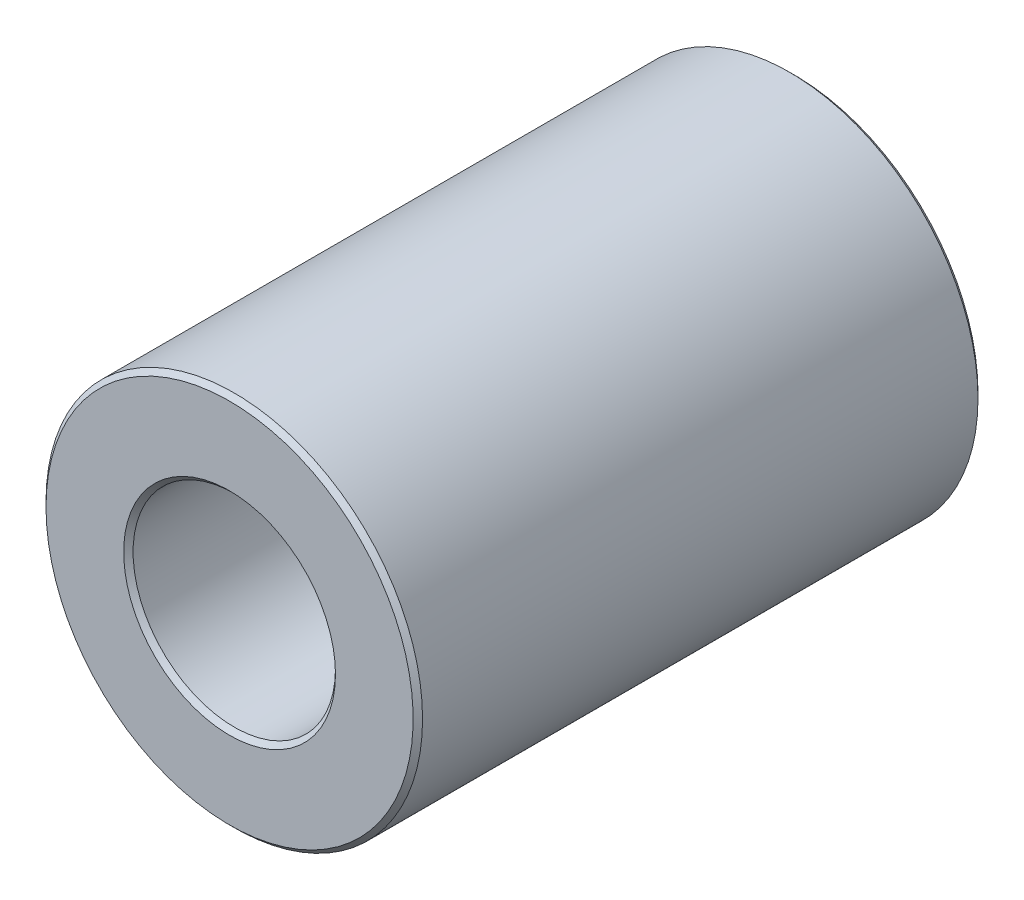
from build123d import *

# Parameters (mm, degrees)
SKETCH1_R           = 4
SKETCH1_R_2         = 2.15
BOSS_EXTRUDE2_DEPTH = 6
CHAMFER3_SIZE       = 0.1


with BuildPart() as part:
    # Sketch1 → Boss-Extrude2 (new, symmetric)
    with BuildSketch(Plane.XY):
        Circle(SKETCH1_R)
        Circle(SKETCH1_R_2, mode=Mode.SUBTRACT)
    extrude(amount=BOSS_EXTRUDE2_DEPTH, both=True)

    # Chamfer3
    chamfer3_edges = [part.edges().sort_by_distance(p)[0] for p in [
        (-4, 0, -6),
        (-4, 0, 6),
        (-2.15, 0, -6),
        (-2.15, 0, 6),
    ]]
    chamfer(chamfer3_edges, length=CHAMFER3_SIZE)


solid = part.part
